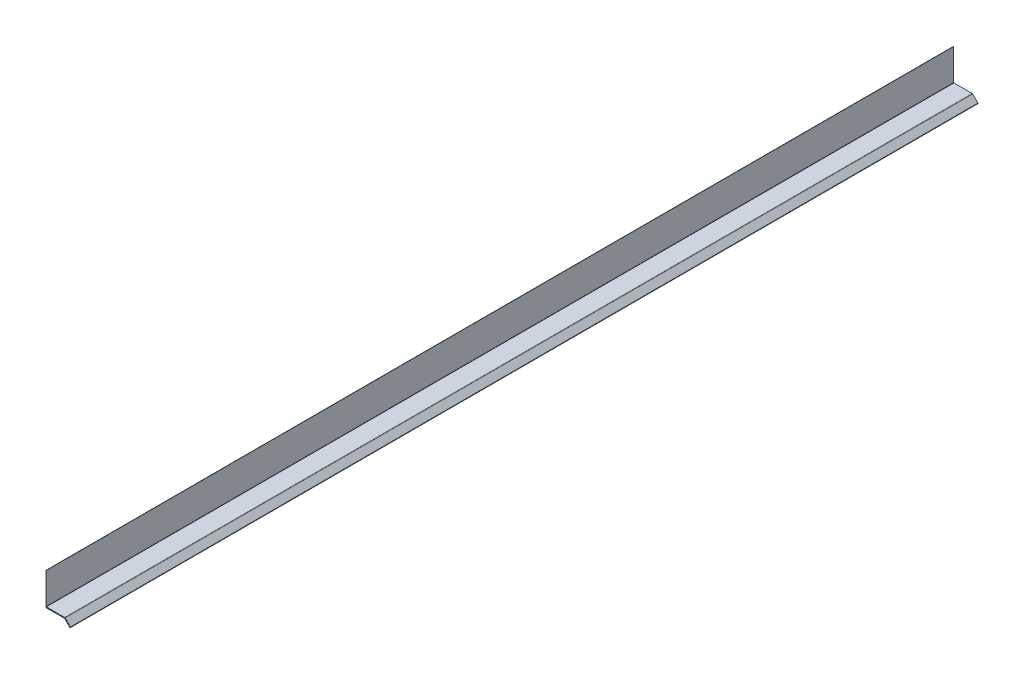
from build123d import *

# Parameters (mm, degrees)
EXTRUDE_THIN1_DEPTH = 2000


with BuildPart() as part:
    # Sketch1 → Extrude-Thin1 (new body)
    with BuildSketch(Plane.XY):
        with BuildLine():
            Line((0.363113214, -1), (41.071206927, -1))
            ThreePointArc((41.071206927, -1), (41.265610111, -1.038669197), (41.430417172, -1.148789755))
            Line((41.430417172, -1.148789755), (52.655737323, -12.374109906))
            ThreePointArc((52.655737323, -12.374109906), (53.362844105, -12.374109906), (53.362844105, -11.667003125))
            Line((53.362844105, -11.667003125), (41.99342049, -0.29757951))
            ThreePointArc((41.99342049, -0.29757951), (41.663806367, -0.077338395), (41.275, 0))
            Line((41.275, 0), (1, 0))
            ThreePointArc((1, 0), (0.292893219, 0.292893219), (0, 1))
            Line((0, 1), (0, 69.85))
            Line((0, 69.85), (0.508, 69.85))
            Line((0.508, 69.85), (0.508, 1))
            ThreePointArc((0.508, 1), (0.652103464, 0.652103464), (1, 0.508))
            Line((1, 0.508), (41.275, 0.508))
            ThreePointArc((41.275, 0.508), (41.858209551, 0.391992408), (42.352630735, 0.061630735))
            Line((42.352630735, 0.061630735), (53.72205435, -11.30779288))
            ThreePointArc((53.72205435, -11.30779288), (53.72205435, -12.733320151), (52.296527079, -12.733320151))
            Line((52.296527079, -12.733320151), (41.071206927, -1.508))
            Line((41.071206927, -1.508), (0.363113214, -1.508))
            Line((0.363113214, -1.508), (0.363113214, -1))
        make_face()
    extrude(amount=EXTRUDE_THIN1_DEPTH)


solid = part.part
